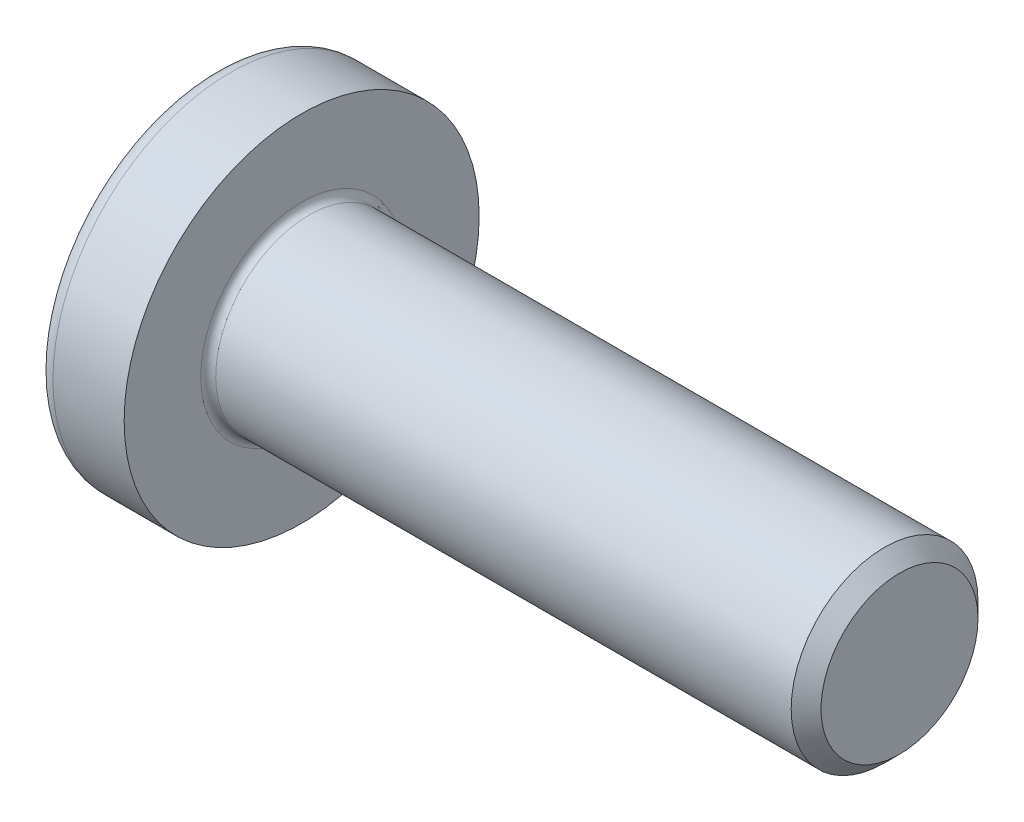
from build123d import *

# Parameters (mm, degrees)
FILLET1_R       = 0.2
RECPAT_COUNT    = 2
RECPAT_ANGLE    = 90
CHANFREIN1_SIZE = 0.4


with BuildPart() as part:
    # BodySke → Base-Revolve (revolve)
    with BuildSketch(Plane.XY, mode=Mode.PRIVATE) as base_revolve_sk:
        with BuildLine():
            Line((3.7, 2.5), (3.7, 4.75))
            Line((3.7, 4.75), (1.79415598, 4.75))
            ThreePointArc((1.79415598, 4.75), (1.58538712, 4.698642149), (1.424271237, 4.556291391))
            ThreePointArc((1.424271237, 4.556291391), (0.364365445, 2.386856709), (0, 0))
            Line((0, 0), (19.7, 0))
            Line((19.7, 0), (19.7, 2.5))
            Line((19.7, 2.5), (3.7, 2.5))
        make_face()
    revolve(base_revolve_sk.sketch.rotate(Axis((1.79415598, 0, 0), (1, 0, 0)), 90), axis=Axis((1.79415598, 0, 0), (1, 0, 0)))

    # Fillet1
    fillet1_edges = [part.edges().sort_by_distance(p)[0] for p in [
        (3.7, 0, -2.5),
    ]]
    fillet(fillet1_edges, radius=FILLET1_R)

    # Sketch3 → Recess section 0
    with BuildSketch(Plane(origin=(0, 0, 0), x_dir=(0, 0, -1), z_dir=(1, 0, 0))):
        with BuildLine():
            Line((0.515, -2.35), (-0.515, -2.35))
            Line((-0.515, -2.35), (-0.515, 2.35))
            Line((-0.515, 2.35), (0.515, 2.35))
            Line((0.515, 2.35), (0.515, -2.35))
        make_face()
    # Sketch4 → Recess section 1
    with BuildSketch(Plane(origin=(2.74, 0, 0), x_dir=(0, 0, -1), z_dir=(1, 0, 0))):
        with BuildLine():
            Line((0.515, -0.983886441), (-0.515, -0.983886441))
            Line((-0.515, -0.983886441), (-0.515, 0.983886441))
            Line((-0.515, 0.983886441), (0.515, 0.983886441))
            Line((0.515, 0.983886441), (0.515, -0.983886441))
        make_face()
    recess = loft(mode=Mode.SUBTRACT)

    # RecPat: Recess ×2 about axis
    recpat_axis = Axis((0, 0, 0), (1, 0, 0))
    for i in range(1, RECPAT_COUNT):
        add(recess.rotate(recpat_axis, i * RECPAT_ANGLE / (RECPAT_COUNT - 1)), mode=Mode.SUBTRACT)

    # RecCorSke → RecessCore (revolve, cut)
    with BuildSketch(Plane.XY, mode=Mode.PRIVATE) as recesscore_sk:
        Polygon((0, 0), (0, 1.042599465), (2.74, 0.851), (3.016506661, 0), align=None)
    revolve(recesscore_sk.sketch.rotate(Axis((-3.175, 0, 0), (1, 0, 0)), 13.238159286), axis=Axis((-3.175, 0, 0), (1, 0, 0)), mode=Mode.SUBTRACT)

    # Chanfrein1
    chanfrein1_edges = [part.edges().sort_by_distance(p)[0] for p in [
        (19.7, 0, -2.5),
    ]]
    chamfer(chanfrein1_edges, length=CHANFREIN1_SIZE)


solid = part.part
